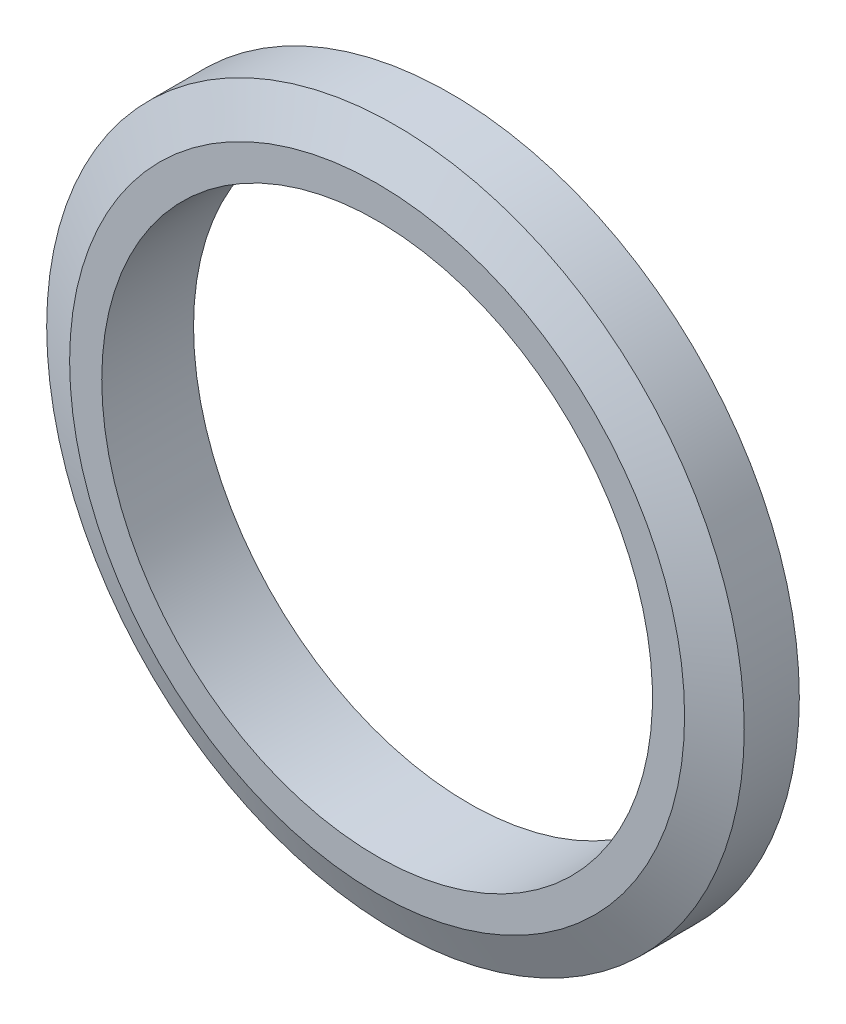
ISO-10303-21;
HEADER;
FILE_DESCRIPTION(('STEP AP214'),'2;1');
FILE_NAME('part.step','',(''),(''),'','','');
FILE_SCHEMA(('AUTOMOTIVE_DESIGN { 1 0 10303 214 1 1 1 1 }'));
ENDSEC;
DATA;
#1=APPLICATION_CONTEXT('core data for automotive mechanical design processes');
#2=APPLICATION_PROTOCOL_DEFINITION('international standard','automotive_design',2000,#1);
#3=PRODUCT_CONTEXT('',#1,'mechanical');
#4=PRODUCT('Part','Part','',(#3));
#5=PRODUCT_RELATED_PRODUCT_CATEGORY('part','',(#4));
#6=PRODUCT_DEFINITION_FORMATION('','',#4);
#7=PRODUCT_DEFINITION_CONTEXT('part definition',#1,'design');
#8=PRODUCT_DEFINITION('design','',#6,#7);
#9=PRODUCT_DEFINITION_SHAPE('','',#8);
#10=(LENGTH_UNIT() NAMED_UNIT(*) SI_UNIT(.MILLI.,.METRE.));
#11=(NAMED_UNIT(*) PLANE_ANGLE_UNIT() SI_UNIT($,.RADIAN.));
#12=(NAMED_UNIT(*) SI_UNIT($,.STERADIAN.) SOLID_ANGLE_UNIT());
#13=UNCERTAINTY_MEASURE_WITH_UNIT(LENGTH_MEASURE(1.E-05),#10,'distance_accuracy_value','');
#14=(GEOMETRIC_REPRESENTATION_CONTEXT(3) GLOBAL_UNCERTAINTY_ASSIGNED_CONTEXT((#13)) GLOBAL_UNIT_ASSIGNED_CONTEXT((#10,
#11,#12)) REPRESENTATION_CONTEXT('',''));
#15=CARTESIAN_POINT('',(0.,0.,0.));
#16=DIRECTION('',(0.,0.,1.));
#17=DIRECTION('',(1.,0.,0.));
#18=AXIS2_PLACEMENT_3D('',#15,#16,#17);
#19=CARTESIAN_POINT('',(60.,295.,15.));
#20=DIRECTION('',(0.,0.,1.));
#21=DIRECTION('',(1.,0.,0.));
#22=AXIS2_PLACEMENT_3D('',#19,#20,#21);
#23=CONICAL_SURFACE('',#22,6.70000000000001,1.15257199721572);
#24=CARTESIAN_POINT('',(60.,295.,15.3999999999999));
#25=DIRECTION('',(0.,0.,-1.));
#26=DIRECTION('',(-1.,0.,0.));
#27=AXIS2_PLACEMENT_3D('',#24,#25,#26);
#28=CIRCLE('',#27,7.60000000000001);
#29=CARTESIAN_POINT('',(52.4,295.,15.3999999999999));
#30=VERTEX_POINT('',#29);
#31=EDGE_CURVE('E10',#30,#30,#28,.T.);
#32=ORIENTED_EDGE('',*,*,#31,.T.);
#33=EDGE_LOOP('',(#32));
#34=FACE_BOUND('',#33,.T.);
#35=CARTESIAN_POINT('',(60.,295.,15.));
#36=DIRECTION('',(0.,0.,-1.));
#37=DIRECTION('',(-1.,0.,0.));
#38=AXIS2_PLACEMENT_3D('',#35,#36,#37);
#39=CIRCLE('',#38,6.70000000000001);
#40=CARTESIAN_POINT('',(53.3,295.,15.));
#41=VERTEX_POINT('',#40);
#42=EDGE_CURVE('E54',#41,#41,#39,.T.);
#43=ORIENTED_EDGE('',*,*,#42,.F.);
#44=EDGE_LOOP('',(#43));
#45=FACE_BOUND('',#44,.T.);
#46=ADVANCED_FACE('F32',(#34,#45),#23,.T.);
#47=CARTESIAN_POINT('',(60.,295.,17.));
#48=DIRECTION('',(0.,0.,-1.));
#49=DIRECTION('',(-1.,0.,0.));
#50=AXIS2_PLACEMENT_3D('',#47,#48,#49);
#51=CYLINDRICAL_SURFACE('',#50,7.60000000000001);
#52=CARTESIAN_POINT('',(60.,295.,16.6));
#53=DIRECTION('',(0.,0.,-1.));
#54=DIRECTION('',(-1.,0.,0.));
#55=AXIS2_PLACEMENT_3D('',#52,#53,#54);
#56=CIRCLE('',#55,7.60000000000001);
#57=CARTESIAN_POINT('',(52.4,295.,16.6));
#58=VERTEX_POINT('',#57);
#59=EDGE_CURVE('E38',#58,#58,#56,.T.);
#60=ORIENTED_EDGE('',*,*,#59,.T.);
#61=EDGE_LOOP('',(#60));
#62=FACE_BOUND('',#61,.T.);
#63=ORIENTED_EDGE('',*,*,#31,.F.);
#64=EDGE_LOOP('',(#63));
#65=FACE_BOUND('',#64,.T.);
#66=ADVANCED_FACE('F62',(#62,#65),#51,.T.);
#67=CARTESIAN_POINT('',(60.,295.,16.6));
#68=DIRECTION('',(0.,0.,-1.));
#69=DIRECTION('',(-1.,0.,0.));
#70=AXIS2_PLACEMENT_3D('',#67,#68,#69);
#71=CONICAL_SURFACE('',#70,7.60000000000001,1.15257199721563);
#72=CARTESIAN_POINT('',(60.,295.,17.));
#73=DIRECTION('',(0.,0.,-1.));
#74=DIRECTION('',(-1.,0.,0.));
#75=AXIS2_PLACEMENT_3D('',#72,#73,#74);
#76=CIRCLE('',#75,6.69999999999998);
#77=CARTESIAN_POINT('',(53.3,295.,17.));
#78=VERTEX_POINT('',#77);
#79=EDGE_CURVE('E42',#78,#78,#76,.T.);
#80=ORIENTED_EDGE('',*,*,#79,.T.);
#81=EDGE_LOOP('',(#80));
#82=FACE_BOUND('',#81,.T.);
#83=ORIENTED_EDGE('',*,*,#59,.F.);
#84=EDGE_LOOP('',(#83));
#85=FACE_BOUND('',#84,.T.);
#86=ADVANCED_FACE('F66',(#82,#85),#71,.T.);
#87=CARTESIAN_POINT('',(66.7,295.,17.));
#88=DIRECTION('',(0.,0.,1.));
#89=DIRECTION('',(1.,0.,0.));
#90=AXIS2_PLACEMENT_3D('',#87,#88,#89);
#91=PLANE('',#90);
#92=CARTESIAN_POINT('',(60.,295.,17.));
#93=DIRECTION('',(0.,0.,-1.));
#94=DIRECTION('',(-1.,0.,0.));
#95=AXIS2_PLACEMENT_3D('',#92,#93,#94);
#96=CIRCLE('',#95,6.00000000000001);
#97=CARTESIAN_POINT('',(54.,295.,17.));
#98=VERTEX_POINT('',#97);
#99=EDGE_CURVE('E46',#98,#98,#96,.T.);
#100=ORIENTED_EDGE('',*,*,#99,.T.);
#101=EDGE_LOOP('',(#100));
#102=FACE_BOUND('',#101,.T.);
#103=ORIENTED_EDGE('',*,*,#79,.F.);
#104=EDGE_LOOP('',(#103));
#105=FACE_BOUND('',#104,.T.);
#106=ADVANCED_FACE('F70',(#102,#105),#91,.T.);
#107=CARTESIAN_POINT('',(60.,295.,17.));
#108=DIRECTION('',(0.,0.,-1.));
#109=DIRECTION('',(-1.,0.,0.));
#110=AXIS2_PLACEMENT_3D('',#107,#108,#109);
#111=CYLINDRICAL_SURFACE('',#110,6.00000000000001);
#112=CARTESIAN_POINT('',(60.,295.,15.));
#113=DIRECTION('',(0.,0.,-1.));
#114=DIRECTION('',(-1.,0.,0.));
#115=AXIS2_PLACEMENT_3D('',#112,#113,#114);
#116=CIRCLE('',#115,6.00000000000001);
#117=CARTESIAN_POINT('',(54.,295.,15.));
#118=VERTEX_POINT('',#117);
#119=EDGE_CURVE('E51',#118,#118,#116,.T.);
#120=ORIENTED_EDGE('',*,*,#119,.T.);
#121=EDGE_LOOP('',(#120));
#122=FACE_BOUND('',#121,.T.);
#123=ORIENTED_EDGE('',*,*,#99,.F.);
#124=EDGE_LOOP('',(#123));
#125=FACE_BOUND('',#124,.T.);
#126=ADVANCED_FACE('F77',(#122,#125),#111,.F.);
#127=CARTESIAN_POINT('',(66.,295.,15.));
#128=DIRECTION('',(0.,0.,-1.));
#129=DIRECTION('',(-1.,0.,0.));
#130=AXIS2_PLACEMENT_3D('',#127,#128,#129);
#131=PLANE('',#130);
#132=ORIENTED_EDGE('',*,*,#42,.T.);
#133=EDGE_LOOP('',(#132));
#134=FACE_BOUND('',#133,.T.);
#135=ORIENTED_EDGE('',*,*,#119,.F.);
#136=EDGE_LOOP('',(#135));
#137=FACE_BOUND('',#136,.T.);
#138=ADVANCED_FACE('F58',(#134,#137),#131,.T.);
#139=CLOSED_SHELL('',(#46,#66,#86,#106,#126,#138));
#140=MANIFOLD_SOLID_BREP('B2',#139);
#141=ADVANCED_BREP_SHAPE_REPRESENTATION('',(#18,#140),#14);
#142=SHAPE_DEFINITION_REPRESENTATION(#9,#141);
ENDSEC;
END-ISO-10303-21;
